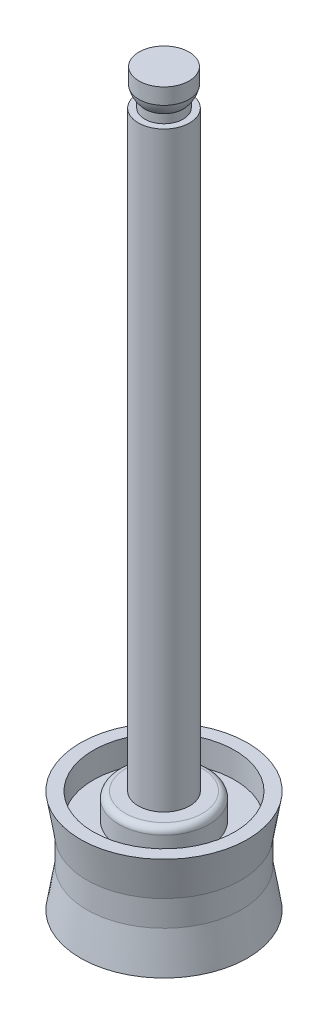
ISO-10303-21;
HEADER;
FILE_DESCRIPTION(('STEP AP214'),'2;1');
FILE_NAME('part.step','',(''),(''),'','','');
FILE_SCHEMA(('AUTOMOTIVE_DESIGN { 1 0 10303 214 1 1 1 1 }'));
ENDSEC;
DATA;
#1=APPLICATION_CONTEXT('core data for automotive mechanical design processes');
#2=APPLICATION_PROTOCOL_DEFINITION('international standard','automotive_design',2000,#1);
#3=PRODUCT_CONTEXT('',#1,'mechanical');
#4=PRODUCT('Part','Part','',(#3));
#5=PRODUCT_RELATED_PRODUCT_CATEGORY('part','',(#4));
#6=PRODUCT_DEFINITION_FORMATION('','',#4);
#7=PRODUCT_DEFINITION_CONTEXT('part definition',#1,'design');
#8=PRODUCT_DEFINITION('design','',#6,#7);
#9=PRODUCT_DEFINITION_SHAPE('','',#8);
#10=(LENGTH_UNIT() NAMED_UNIT(*) SI_UNIT(.MILLI.,.METRE.));
#11=(NAMED_UNIT(*) PLANE_ANGLE_UNIT() SI_UNIT($,.RADIAN.));
#12=(NAMED_UNIT(*) SI_UNIT($,.STERADIAN.) SOLID_ANGLE_UNIT());
#13=UNCERTAINTY_MEASURE_WITH_UNIT(LENGTH_MEASURE(1.E-05),#10,'distance_accuracy_value','');
#14=(GEOMETRIC_REPRESENTATION_CONTEXT(3) GLOBAL_UNCERTAINTY_ASSIGNED_CONTEXT((#13)) GLOBAL_UNIT_ASSIGNED_CONTEXT((#10,
#11,#12)) REPRESENTATION_CONTEXT('',''));
#15=CARTESIAN_POINT('',(0.,0.,0.));
#16=DIRECTION('',(0.,0.,1.));
#17=DIRECTION('',(1.,0.,0.));
#18=AXIS2_PLACEMENT_3D('',#15,#16,#17);
#19=CARTESIAN_POINT('',(0.,8.,0.));
#20=DIRECTION('',(0.,1.,0.));
#21=DIRECTION('',(0.,0.,1.));
#22=AXIS2_PLACEMENT_3D('',#19,#20,#21);
#23=PLANE('',#22);
#24=CARTESIAN_POINT('',(0.,8.,0.));
#25=DIRECTION('',(0.,1.,0.));
#26=DIRECTION('',(0.,0.,1.));
#27=AXIS2_PLACEMENT_3D('',#24,#25,#26);
#28=CIRCLE('',#27,5.5);
#29=CARTESIAN_POINT('',(0.,8.,5.5));
#30=VERTEX_POINT('',#29);
#31=EDGE_CURVE('E99',#30,#30,#28,.T.);
#32=ORIENTED_EDGE('',*,*,#31,.F.);
#33=EDGE_LOOP('',(#32));
#34=FACE_BOUND('',#33,.T.);
#35=CARTESIAN_POINT('',(0.,8.,0.));
#36=DIRECTION('',(0.,-1.,0.));
#37=DIRECTION('',(0.,0.,-1.));
#38=AXIS2_PLACEMENT_3D('',#35,#36,#37);
#39=CIRCLE('',#38,6.5);
#40=CARTESIAN_POINT('',(0.,8.,-6.5));
#41=VERTEX_POINT('',#40);
#42=EDGE_CURVE('E77',#41,#41,#39,.T.);
#43=ORIENTED_EDGE('',*,*,#42,.F.);
#44=EDGE_LOOP('',(#43));
#45=FACE_BOUND('',#44,.T.);
#46=ADVANCED_FACE('F39',(#34,#45),#23,.T.);
#47=CARTESIAN_POINT('',(0.,5.,0.));
#48=DIRECTION('',(0.,1.,0.));
#49=DIRECTION('',(0.,0.,1.));
#50=AXIS2_PLACEMENT_3D('',#47,#48,#49);
#51=CONICAL_SURFACE('',#50,6.,0.165148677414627);
#52=ORIENTED_EDGE('',*,*,#42,.T.);
#53=EDGE_LOOP('',(#52));
#54=FACE_BOUND('',#53,.T.);
#55=CARTESIAN_POINT('',(0.,5.,0.));
#56=DIRECTION('',(0.,-1.,0.));
#57=DIRECTION('',(0.,0.,-1.));
#58=AXIS2_PLACEMENT_3D('',#55,#56,#57);
#59=CIRCLE('',#58,6.);
#60=CARTESIAN_POINT('',(0.,5.,-6.));
#61=VERTEX_POINT('',#60);
#62=EDGE_CURVE('E86',#61,#61,#59,.T.);
#63=ORIENTED_EDGE('',*,*,#62,.F.);
#64=EDGE_LOOP('',(#63));
#65=FACE_BOUND('',#64,.T.);
#66=ADVANCED_FACE('F125',(#54,#65),#51,.T.);
#67=CARTESIAN_POINT('',(0.,0.,0.));
#68=DIRECTION('',(0.,-1.,0.));
#69=DIRECTION('',(0.,0.,-1.));
#70=AXIS2_PLACEMENT_3D('',#67,#68,#69);
#71=CONICAL_SURFACE('',#70,6.5,0.165148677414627);
#72=CARTESIAN_POINT('',(0.,3.,0.));
#73=DIRECTION('',(0.,-1.,0.));
#74=DIRECTION('',(0.,0.,-1.));
#75=AXIS2_PLACEMENT_3D('',#72,#73,#74);
#76=CIRCLE('',#75,6.);
#77=CARTESIAN_POINT('',(0.,3.,-6.));
#78=VERTEX_POINT('',#77);
#79=EDGE_CURVE('E83',#78,#78,#76,.T.);
#80=ORIENTED_EDGE('',*,*,#79,.T.);
#81=EDGE_LOOP('',(#80));
#82=FACE_BOUND('',#81,.T.);
#83=CARTESIAN_POINT('',(0.,0.,0.));
#84=DIRECTION('',(0.,-1.,0.));
#85=DIRECTION('',(0.,0.,-1.));
#86=AXIS2_PLACEMENT_3D('',#83,#84,#85);
#87=CIRCLE('',#86,6.5);
#88=CARTESIAN_POINT('',(0.,0.,-6.5));
#89=VERTEX_POINT('',#88);
#90=EDGE_CURVE('E80',#89,#89,#87,.T.);
#91=ORIENTED_EDGE('',*,*,#90,.F.);
#92=EDGE_LOOP('',(#91));
#93=FACE_BOUND('',#92,.T.);
#94=ADVANCED_FACE('F132',(#82,#93),#71,.T.);
#95=CARTESIAN_POINT('',(0.,0.,0.));
#96=DIRECTION('',(0.,-1.,0.));
#97=DIRECTION('',(0.,0.,-1.));
#98=AXIS2_PLACEMENT_3D('',#95,#96,#97);
#99=CYLINDRICAL_SURFACE('',#98,6.);
#100=ORIENTED_EDGE('',*,*,#62,.T.);
#101=EDGE_LOOP('',(#100));
#102=FACE_BOUND('',#101,.T.);
#103=ORIENTED_EDGE('',*,*,#79,.F.);
#104=EDGE_LOOP('',(#103));
#105=FACE_BOUND('',#104,.T.);
#106=ADVANCED_FACE('F136',(#102,#105),#99,.T.);
#107=CARTESIAN_POINT('',(0.,0.,0.));
#108=DIRECTION('',(0.,1.,0.));
#109=DIRECTION('',(0.,0.,1.));
#110=AXIS2_PLACEMENT_3D('',#107,#108,#109);
#111=PLANE('',#110);
#112=CARTESIAN_POINT('',(0.,0.,0.));
#113=DIRECTION('',(0.,-1.,0.));
#114=DIRECTION('',(0.,0.,-1.));
#115=AXIS2_PLACEMENT_3D('',#112,#113,#114);
#116=CIRCLE('',#115,5.5);
#117=CARTESIAN_POINT('',(0.,0.,-5.5));
#118=VERTEX_POINT('',#117);
#119=EDGE_CURVE('E90',#118,#118,#116,.T.);
#120=ORIENTED_EDGE('',*,*,#119,.F.);
#121=EDGE_LOOP('',(#120));
#122=FACE_BOUND('',#121,.T.);
#123=ORIENTED_EDGE('',*,*,#90,.T.);
#124=EDGE_LOOP('',(#123));
#125=FACE_BOUND('',#124,.T.);
#126=ADVANCED_FACE('F139',(#122,#125),#111,.F.);
#127=CARTESIAN_POINT('',(0.,2.,0.));
#128=DIRECTION('',(0.,-1.,0.));
#129=DIRECTION('',(0.,0.,-1.));
#130=AXIS2_PLACEMENT_3D('',#127,#128,#129);
#131=CYLINDRICAL_SURFACE('',#130,5.5);
#132=CARTESIAN_POINT('',(0.,2.,0.));
#133=DIRECTION('',(0.,-1.,0.));
#134=DIRECTION('',(0.,0.,-1.));
#135=AXIS2_PLACEMENT_3D('',#132,#133,#134);
#136=CIRCLE('',#135,5.5);
#137=CARTESIAN_POINT('',(0.,2.,-5.5));
#138=VERTEX_POINT('',#137);
#139=EDGE_CURVE('E89',#138,#138,#136,.T.);
#140=ORIENTED_EDGE('',*,*,#139,.F.);
#141=EDGE_LOOP('',(#140));
#142=FACE_BOUND('',#141,.T.);
#143=ORIENTED_EDGE('',*,*,#119,.T.);
#144=EDGE_LOOP('',(#143));
#145=FACE_BOUND('',#144,.T.);
#146=ADVANCED_FACE('F149',(#142,#145),#131,.F.);
#147=CARTESIAN_POINT('',(0.,2.,0.));
#148=DIRECTION('',(0.,-1.,0.));
#149=DIRECTION('',(0.,0.,-1.));
#150=AXIS2_PLACEMENT_3D('',#147,#148,#149);
#151=PLANE('',#150);
#152=CARTESIAN_POINT('',(0.,2.,0.));
#153=DIRECTION('',(0.,-1.,0.));
#154=DIRECTION('',(0.,0.,-1.));
#155=AXIS2_PLACEMENT_3D('',#152,#153,#154);
#156=CIRCLE('',#155,3.5);
#157=CARTESIAN_POINT('',(0.,2.,-3.5));
#158=VERTEX_POINT('',#157);
#159=EDGE_CURVE('E93',#158,#158,#156,.T.);
#160=ORIENTED_EDGE('',*,*,#159,.F.);
#161=EDGE_LOOP('',(#160));
#162=FACE_BOUND('',#161,.T.);
#163=ORIENTED_EDGE('',*,*,#139,.T.);
#164=EDGE_LOOP('',(#163));
#165=FACE_BOUND('',#164,.T.);
#166=ADVANCED_FACE('F155',(#162,#165),#151,.T.);
#167=CARTESIAN_POINT('',(0.,2.,0.));
#168=DIRECTION('',(0.,-1.,0.));
#169=DIRECTION('',(0.,0.,-1.));
#170=AXIS2_PLACEMENT_3D('',#167,#168,#169);
#171=CYLINDRICAL_SURFACE('',#170,3.5);
#172=CARTESIAN_POINT('',(0.,0.5,0.));
#173=DIRECTION('',(0.,1.,0.));
#174=DIRECTION('',(0.,0.,1.));
#175=AXIS2_PLACEMENT_3D('',#172,#173,#174);
#176=CIRCLE('',#175,3.5);
#177=CARTESIAN_POINT('',(0.,0.5,3.5));
#178=VERTEX_POINT('',#177);
#179=EDGE_CURVE('E50',#178,#178,#176,.T.);
#180=ORIENTED_EDGE('',*,*,#179,.T.);
#181=EDGE_LOOP('',(#180));
#182=FACE_BOUND('',#181,.T.);
#183=ORIENTED_EDGE('',*,*,#159,.T.);
#184=EDGE_LOOP('',(#183));
#185=FACE_BOUND('',#184,.T.);
#186=ADVANCED_FACE('F160',(#182,#185),#171,.T.);
#187=CARTESIAN_POINT('',(0.,0.,0.));
#188=DIRECTION('',(0.,1.,0.));
#189=DIRECTION('',(0.,0.,1.));
#190=AXIS2_PLACEMENT_3D('',#187,#188,#189);
#191=CIRCLE('',#190,3.);
#192=CARTESIAN_POINT('',(0.,0.,3.));
#193=VERTEX_POINT('',#192);
#194=EDGE_CURVE('E54',#193,#193,#191,.F.);
#195=ORIENTED_EDGE('',*,*,#194,.T.);
#196=EDGE_LOOP('',(#195));
#197=FACE_BOUND('',#196,.T.);
#198=ADVANCED_FACE('F119',(#197),#111,.F.);
#199=CARTESIAN_POINT('',(0.,6.,0.));
#200=DIRECTION('',(0.,1.,0.));
#201=DIRECTION('',(0.,0.,1.));
#202=AXIS2_PLACEMENT_3D('',#199,#200,#201);
#203=CYLINDRICAL_SURFACE('',#202,5.5);
#204=CARTESIAN_POINT('',(0.,6.,0.));
#205=DIRECTION('',(0.,1.,0.));
#206=DIRECTION('',(0.,0.,1.));
#207=AXIS2_PLACEMENT_3D('',#204,#205,#206);
#208=CIRCLE('',#207,5.5);
#209=CARTESIAN_POINT('',(0.,6.,5.5));
#210=VERTEX_POINT('',#209);
#211=EDGE_CURVE('E98',#210,#210,#208,.T.);
#212=ORIENTED_EDGE('',*,*,#211,.F.);
#213=EDGE_LOOP('',(#212));
#214=FACE_BOUND('',#213,.T.);
#215=ORIENTED_EDGE('',*,*,#31,.T.);
#216=EDGE_LOOP('',(#215));
#217=FACE_BOUND('',#216,.T.);
#218=ADVANCED_FACE('F113',(#214,#217),#203,.F.);
#219=CARTESIAN_POINT('',(0.,6.,0.));
#220=DIRECTION('',(0.,1.,0.));
#221=DIRECTION('',(0.,0.,1.));
#222=AXIS2_PLACEMENT_3D('',#219,#220,#221);
#223=PLANE('',#222);
#224=CARTESIAN_POINT('',(0.,6.,0.));
#225=DIRECTION('',(0.,1.,0.));
#226=DIRECTION('',(0.,0.,1.));
#227=AXIS2_PLACEMENT_3D('',#224,#225,#226);
#228=CIRCLE('',#227,3.5);
#229=CARTESIAN_POINT('',(0.,6.,3.5));
#230=VERTEX_POINT('',#229);
#231=EDGE_CURVE('E102',#230,#230,#228,.T.);
#232=ORIENTED_EDGE('',*,*,#231,.F.);
#233=EDGE_LOOP('',(#232));
#234=FACE_BOUND('',#233,.T.);
#235=ORIENTED_EDGE('',*,*,#211,.T.);
#236=EDGE_LOOP('',(#235));
#237=FACE_BOUND('',#236,.T.);
#238=ADVANCED_FACE('F110',(#234,#237),#223,.T.);
#239=CARTESIAN_POINT('',(0.,6.,0.));
#240=DIRECTION('',(0.,1.,0.));
#241=DIRECTION('',(0.,0.,1.));
#242=AXIS2_PLACEMENT_3D('',#239,#240,#241);
#243=CYLINDRICAL_SURFACE('',#242,3.5);
#244=CARTESIAN_POINT('',(0.,7.5,0.));
#245=DIRECTION('',(0.,1.,0.));
#246=DIRECTION('',(0.,0.,1.));
#247=AXIS2_PLACEMENT_3D('',#244,#245,#246);
#248=CIRCLE('',#247,3.5);
#249=CARTESIAN_POINT('',(0.,7.5,3.5));
#250=VERTEX_POINT('',#249);
#251=EDGE_CURVE('E10',#250,#250,#248,.F.);
#252=ORIENTED_EDGE('',*,*,#251,.T.);
#253=EDGE_LOOP('',(#252));
#254=FACE_BOUND('',#253,.T.);
#255=ORIENTED_EDGE('',*,*,#231,.T.);
#256=EDGE_LOOP('',(#255));
#257=FACE_BOUND('',#256,.T.);
#258=ADVANCED_FACE('F108',(#254,#257),#243,.T.);
#259=CARTESIAN_POINT('',(0.,56.8,0.));
#260=DIRECTION('',(0.,1.,0.));
#261=DIRECTION('',(0.,0.,1.));
#262=AXIS2_PLACEMENT_3D('',#259,#260,#261);
#263=PLANE('',#262);
#264=CARTESIAN_POINT('',(0.,56.8,0.));
#265=DIRECTION('',(0.,-1.,0.));
#266=DIRECTION('',(0.,0.,-1.));
#267=AXIS2_PLACEMENT_3D('',#264,#265,#266);
#268=CIRCLE('',#267,1.95);
#269=CARTESIAN_POINT('',(0.,56.8,-1.95));
#270=VERTEX_POINT('',#269);
#271=EDGE_CURVE('E74',#270,#270,#268,.T.);
#272=ORIENTED_EDGE('',*,*,#271,.F.);
#273=EDGE_LOOP('',(#272));
#274=FACE_BOUND('',#273,.T.);
#275=ADVANCED_FACE('F190',(#274),#263,.T.);
#276=CARTESIAN_POINT('',(0.,54.,0.));
#277=DIRECTION('',(0.,-1.,0.));
#278=DIRECTION('',(0.,0.,-1.));
#279=AXIS2_PLACEMENT_3D('',#276,#277,#278);
#280=CYLINDRICAL_SURFACE('',#279,1.95);
#281=ORIENTED_EDGE('',*,*,#271,.T.);
#282=EDGE_LOOP('',(#281));
#283=FACE_BOUND('',#282,.T.);
#284=CARTESIAN_POINT('',(0.,55.5555902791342,0.));
#285=DIRECTION('',(0.,-1.,0.));
#286=DIRECTION('',(0.,0.,-1.));
#287=AXIS2_PLACEMENT_3D('',#284,#285,#286);
#288=CIRCLE('',#287,1.95);
#289=CARTESIAN_POINT('',(1.95,55.5555902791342,0.));
#290=VERTEX_POINT('',#289);
#291=EDGE_CURVE('E71',#290,#290,#288,.T.);
#292=ORIENTED_EDGE('',*,*,#291,.F.);
#293=EDGE_LOOP('',(#292));
#294=FACE_BOUND('',#293,.T.);
#295=ADVANCED_FACE('F193',(#283,#294),#280,.T.);
#296=CARTESIAN_POINT('',(0.,56.,0.));
#297=DIRECTION('',(0.,-1.,0.));
#298=DIRECTION('',(1.,0.,0.));
#299=AXIS2_PLACEMENT_3D('',#296,#297,#298);
#300=SPHERICAL_SURFACE('',#299,2.);
#301=CARTESIAN_POINT('',(0.,54.6771243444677,0.));
#302=DIRECTION('',(0.,-1.,0.));
#303=DIRECTION('',(0.,0.,-1.));
#304=AXIS2_PLACEMENT_3D('',#301,#302,#303);
#305=CIRCLE('',#304,1.5);
#306=CARTESIAN_POINT('',(1.5,54.6771243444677,0.));
#307=VERTEX_POINT('',#306);
#308=EDGE_CURVE('E66',#307,#307,#305,.T.);
#309=CARTESIAN_POINT('',(1.95,55.5555902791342,0.));
#310=CARTESIAN_POINT('',(1.94769158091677,55.545461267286,0.));
#311=CARTESIAN_POINT('',(1.94530422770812,55.5353502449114,0.));
#312=CARTESIAN_POINT('',(1.94037226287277,55.5151666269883,0.));
#313=CARTESIAN_POINT('',(1.93782765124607,55.5050940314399,0.));
#314=CARTESIAN_POINT('',(1.93258177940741,55.4849897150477,0.));
#315=CARTESIAN_POINT('',(1.92988051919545,55.474957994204,0.));
#316=CARTESIAN_POINT('',(1.92432200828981,55.4549378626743,0.));
#317=CARTESIAN_POINT('',(1.92146475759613,55.4449494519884,0.));
#318=CARTESIAN_POINT('',(1.91559495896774,55.4250183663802,0.));
#319=CARTESIAN_POINT('',(1.91258241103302,55.4150756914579,0.));
#320=CARTESIAN_POINT('',(1.90640274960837,55.3952384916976,0.));
#321=CARTESIAN_POINT('',(1.90323563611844,55.3853439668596,0.));
#322=CARTESIAN_POINT('',(1.89674761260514,55.3656054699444,0.));
#323=CARTESIAN_POINT('',(1.89342670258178,55.3557614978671,0.));
#324=CARTESIAN_POINT('',(1.88663189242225,55.3361264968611,0.));
#325=CARTESIAN_POINT('',(1.88315799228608,55.3263354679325,0.));
#326=CARTESIAN_POINT('',(1.8760580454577,55.3068087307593,0.));
#327=CARTESIAN_POINT('',(1.87243199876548,55.2970730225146,0.));
#328=CARTESIAN_POINT('',(1.86502863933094,55.2776592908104,0.));
#329=CARTESIAN_POINT('',(1.86125132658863,55.2679812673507,0.));
#330=CARTESIAN_POINT('',(1.85354635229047,55.2486852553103,0.));
#331=CARTESIAN_POINT('',(1.84961869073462,55.2390672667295,0.));
#332=CARTESIAN_POINT('',(1.84161397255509,55.2198936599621,0.));
#333=CARTESIAN_POINT('',(1.83753691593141,55.2103380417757,0.));
#334=CARTESIAN_POINT('',(1.82923439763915,55.1912914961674,0.));
#335=CARTESIAN_POINT('',(1.82500893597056,55.1818005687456,0.));
#336=CARTESIAN_POINT('',(1.81641063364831,55.1628857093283,0.));
#337=CARTESIAN_POINT('',(1.81203779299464,55.1534617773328,0.));
#338=CARTESIAN_POINT('',(1.80314579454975,55.1346831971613,0.));
#339=CARTESIAN_POINT('',(1.79862663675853,55.1253285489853,0.));
#340=CARTESIAN_POINT('',(1.78944310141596,55.1066908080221,0.));
#341=CARTESIAN_POINT('',(1.78477872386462,55.0974077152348,0.));
#342=CARTESIAN_POINT('',(1.77530588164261,55.0789153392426,0.));
#343=CARTESIAN_POINT('',(1.77049741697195,55.0697060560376,0.));
#344=CARTESIAN_POINT('',(1.76073756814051,55.0513635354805,0.));
#345=CARTESIAN_POINT('',(1.75578618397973,55.0422302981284,0.));
#346=CARTESIAN_POINT('',(1.74574169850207,55.0240420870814,0.));
#347=CARTESIAN_POINT('',(1.74064859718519,55.0149871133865,0.));
#348=CARTESIAN_POINT('',(1.73032191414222,54.996957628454,0.));
#349=CARTESIAN_POINT('',(1.72508833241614,54.9879831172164,0.));
#350=CARTESIAN_POINT('',(1.71448195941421,54.9701167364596,0.));
#351=CARTESIAN_POINT('',(1.70910916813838,54.9612248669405,0.));
#352=CARTESIAN_POINT('',(1.69822568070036,54.9435259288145,0.));
#353=CARTESIAN_POINT('',(1.69271498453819,54.9347188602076,0.));
#354=CARTESIAN_POINT('',(1.68155702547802,54.9171916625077,0.));
#355=CARTESIAN_POINT('',(1.67590976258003,54.9084715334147,0.));
#356=CARTESIAN_POINT('',(1.66448004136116,54.8911203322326,0.));
#357=CARTESIAN_POINT('',(1.65869758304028,54.8824892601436,0.));
#358=CARTESIAN_POINT('',(1.646998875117,54.8653182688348,0.));
#359=CARTESIAN_POINT('',(1.64108262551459,54.8567783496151,0.));
#360=CARTESIAN_POINT('',(1.62911777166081,54.8397917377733,0.));
#361=CARTESIAN_POINT('',(1.62306916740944,54.8313450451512,0.));
#362=CARTESIAN_POINT('',(1.61084107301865,54.8145469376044,0.));
#363=CARTESIAN_POINT('',(1.60466158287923,54.8061955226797,0.));
#364=CARTESIAN_POINT('',(1.59217321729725,54.789589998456,0.));
#365=CARTESIAN_POINT('',(1.58586434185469,54.7813358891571,0.));
#366=CARTESIAN_POINT('',(1.57311873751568,54.7649269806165,0.));
#367=CARTESIAN_POINT('',(1.56668200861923,54.7567721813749,0.));
#368=CARTESIAN_POINT('',(1.55368226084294,54.7405638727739,0.));
#369=CARTESIAN_POINT('',(1.54711924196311,54.7325103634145,0.));
#370=CARTESIAN_POINT('',(1.53386850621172,54.7165065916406,0.));
#371=CARTESIAN_POINT('',(1.52718078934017,54.708556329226,0.));
#372=CARTESIAN_POINT('',(1.51368228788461,54.69276097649,0.));
#373=CARTESIAN_POINT('',(1.5068715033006,54.6849158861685,0.));
#374=CARTESIAN_POINT('',(1.5,54.6771243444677,0.));
#375=B_SPLINE_CURVE_WITH_KNOTS('',3,(#309,#310,#311,#312,#313,#314,#315,#316,#317,#318,#319,
#320,#321,#322,#323,#324,#325,#326,#327,#328,#329,#330,#331,#332,#333,#334,#335,#336,#337,#338,
#339,#340,#341,#342,#343,#344,#345,#346,#347,#348,#349,#350,#351,#352,#353,#354,#355,#356,#357,
#358,#359,#360,#361,#362,#363,#364,#365,#366,#367,#368,#369,#370,#371,#372,#373,#374),
.UNSPECIFIED.,.F.,.F.,(4,2,2,2,2,2,2,2,2,2,2,2,2,2,2,2,2,2,2,2,2,2,2,2,2,2,2,2,2,2,2,2,4),(0.,
0.0311658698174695,0.0623317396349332,0.0934976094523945,0.124663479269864,0.155829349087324,
0.186995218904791,0.218161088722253,0.249326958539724,0.280492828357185,0.311658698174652,
0.342824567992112,0.373990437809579,0.405156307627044,0.436322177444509,0.467488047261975,
0.498653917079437,0.529819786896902,0.560985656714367,0.59215152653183,0.623317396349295,
0.654483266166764,0.685649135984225,0.716815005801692,0.747980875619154,0.779146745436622,
0.810312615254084,0.841478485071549,0.872644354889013,0.903810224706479,0.934976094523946,
0.966141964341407,0.99730783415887),.UNSPECIFIED.);
#376=EDGE_CURVE('BSEAM197',#290,#307,#375,.T.);
#377=ORIENTED_EDGE('',*,*,#291,.T.);
#378=ORIENTED_EDGE('',*,*,#308,.F.);
#379=ORIENTED_EDGE('',*,*,#376,.T.);
#380=ORIENTED_EDGE('',*,*,#376,.F.);
#381=EDGE_LOOP('',(#377,#379,#378,#380));
#382=FACE_BOUND('',#381,.T.);
#383=ADVANCED_FACE('F197',(#382),#300,.T.);
#384=CARTESIAN_POINT('',(0.,54.,0.));
#385=DIRECTION('',(0.,-1.,0.));
#386=DIRECTION('',(0.,0.,-1.));
#387=AXIS2_PLACEMENT_3D('',#384,#385,#386);
#388=CYLINDRICAL_SURFACE('',#387,1.5);
#389=ORIENTED_EDGE('',*,*,#308,.T.);
#390=EDGE_LOOP('',(#389));
#391=FACE_BOUND('',#390,.T.);
#392=CARTESIAN_POINT('',(0.,54.,0.));
#393=DIRECTION('',(0.,1.,0.));
#394=DIRECTION('',(0.,0.,1.));
#395=AXIS2_PLACEMENT_3D('',#392,#393,#394);
#396=CIRCLE('',#395,1.5);
#397=CARTESIAN_POINT('',(0.,54.,1.5));
#398=VERTEX_POINT('',#397);
#399=EDGE_CURVE('E59',#398,#398,#396,.T.);
#400=ORIENTED_EDGE('',*,*,#399,.T.);
#401=EDGE_LOOP('',(#400));
#402=FACE_BOUND('',#401,.T.);
#403=ADVANCED_FACE('F201',(#391,#402),#388,.T.);
#404=CARTESIAN_POINT('',(0.,54.,0.));
#405=DIRECTION('',(0.,1.,0.));
#406=DIRECTION('',(0.,0.,1.));
#407=AXIS2_PLACEMENT_3D('',#404,#405,#406);
#408=PLANE('',#407);
#409=ORIENTED_EDGE('',*,*,#399,.F.);
#410=EDGE_LOOP('',(#409));
#411=FACE_BOUND('',#410,.T.);
#412=CARTESIAN_POINT('',(0.,54.,0.));
#413=DIRECTION('',(0.,1.,0.));
#414=DIRECTION('',(0.,0.,1.));
#415=AXIS2_PLACEMENT_3D('',#412,#413,#414);
#416=CIRCLE('',#415,2.);
#417=CARTESIAN_POINT('',(0.,54.,2.));
#418=VERTEX_POINT('',#417);
#419=EDGE_CURVE('E62',#418,#418,#416,.T.);
#420=ORIENTED_EDGE('',*,*,#419,.T.);
#421=EDGE_LOOP('',(#420));
#422=FACE_BOUND('',#421,.T.);
#423=ADVANCED_FACE('F205',(#411,#422),#408,.T.);
#424=CARTESIAN_POINT('',(0.,54.,0.));
#425=DIRECTION('',(0.,-1.,0.));
#426=DIRECTION('',(0.,0.,-1.));
#427=AXIS2_PLACEMENT_3D('',#424,#425,#426);
#428=CYLINDRICAL_SURFACE('',#427,2.);
#429=ORIENTED_EDGE('',*,*,#419,.F.);
#430=EDGE_LOOP('',(#429));
#431=FACE_BOUND('',#430,.T.);
#432=CARTESIAN_POINT('',(0.,8.,0.));
#433=DIRECTION('',(0.,1.,0.));
#434=DIRECTION('',(0.,0.,1.));
#435=AXIS2_PLACEMENT_3D('',#432,#433,#434);
#436=CIRCLE('',#435,2.);
#437=CARTESIAN_POINT('',(0.,8.,2.));
#438=VERTEX_POINT('',#437);
#439=EDGE_CURVE('E63',#438,#438,#436,.T.);
#440=ORIENTED_EDGE('',*,*,#439,.T.);
#441=EDGE_LOOP('',(#440));
#442=FACE_BOUND('',#441,.T.);
#443=ADVANCED_FACE('F177',(#431,#442),#428,.T.);
#444=CARTESIAN_POINT('',(0.,8.,0.));
#445=DIRECTION('',(0.,1.,0.));
#446=DIRECTION('',(0.,0.,1.));
#447=AXIS2_PLACEMENT_3D('',#444,#445,#446);
#448=CIRCLE('',#447,3.);
#449=CARTESIAN_POINT('',(0.,8.,3.));
#450=VERTEX_POINT('',#449);
#451=EDGE_CURVE('E46',#450,#450,#448,.T.);
#452=ORIENTED_EDGE('',*,*,#451,.T.);
#453=EDGE_LOOP('',(#452));
#454=FACE_BOUND('',#453,.T.);
#455=ORIENTED_EDGE('',*,*,#439,.F.);
#456=EDGE_LOOP('',(#455));
#457=FACE_BOUND('',#456,.T.);
#458=ADVANCED_FACE('F127',(#454,#457),#23,.T.);
#459=CARTESIAN_POINT('',(0.,0.5,0.));
#460=DIRECTION('',(0.,1.,0.));
#461=DIRECTION('',(0.,0.,1.));
#462=AXIS2_PLACEMENT_3D('',#459,#460,#461);
#463=TOROIDAL_SURFACE('',#462,3.,0.5);
#464=ORIENTED_EDGE('',*,*,#179,.F.);
#465=EDGE_LOOP('',(#464));
#466=FACE_BOUND('',#465,.T.);
#467=ORIENTED_EDGE('',*,*,#194,.F.);
#468=EDGE_LOOP('',(#467));
#469=FACE_BOUND('',#468,.T.);
#470=ADVANCED_FACE('F169',(#466,#469),#463,.T.);
#471=CARTESIAN_POINT('',(0.,7.5,0.));
#472=DIRECTION('',(0.,1.,0.));
#473=DIRECTION('',(0.,0.,1.));
#474=AXIS2_PLACEMENT_3D('',#471,#472,#473);
#475=TOROIDAL_SURFACE('',#474,3.,0.5);
#476=ORIENTED_EDGE('',*,*,#251,.F.);
#477=EDGE_LOOP('',(#476));
#478=FACE_BOUND('',#477,.T.);
#479=ORIENTED_EDGE('',*,*,#451,.F.);
#480=EDGE_LOOP('',(#479));
#481=FACE_BOUND('',#480,.T.);
#482=ADVANCED_FACE('F41',(#478,#481),#475,.T.);
#483=CLOSED_SHELL('',(#46,#66,#94,#106,#126,#146,#166,#186,#198,#218,#238,#258,#275,#295,#383,
#403,#423,#443,#458,#470,#482));
#484=MANIFOLD_SOLID_BREP('B2',#483);
#485=ADVANCED_BREP_SHAPE_REPRESENTATION('',(#18,#484),#14);
#486=SHAPE_DEFINITION_REPRESENTATION(#9,#485);
ENDSEC;
END-ISO-10303-21;
